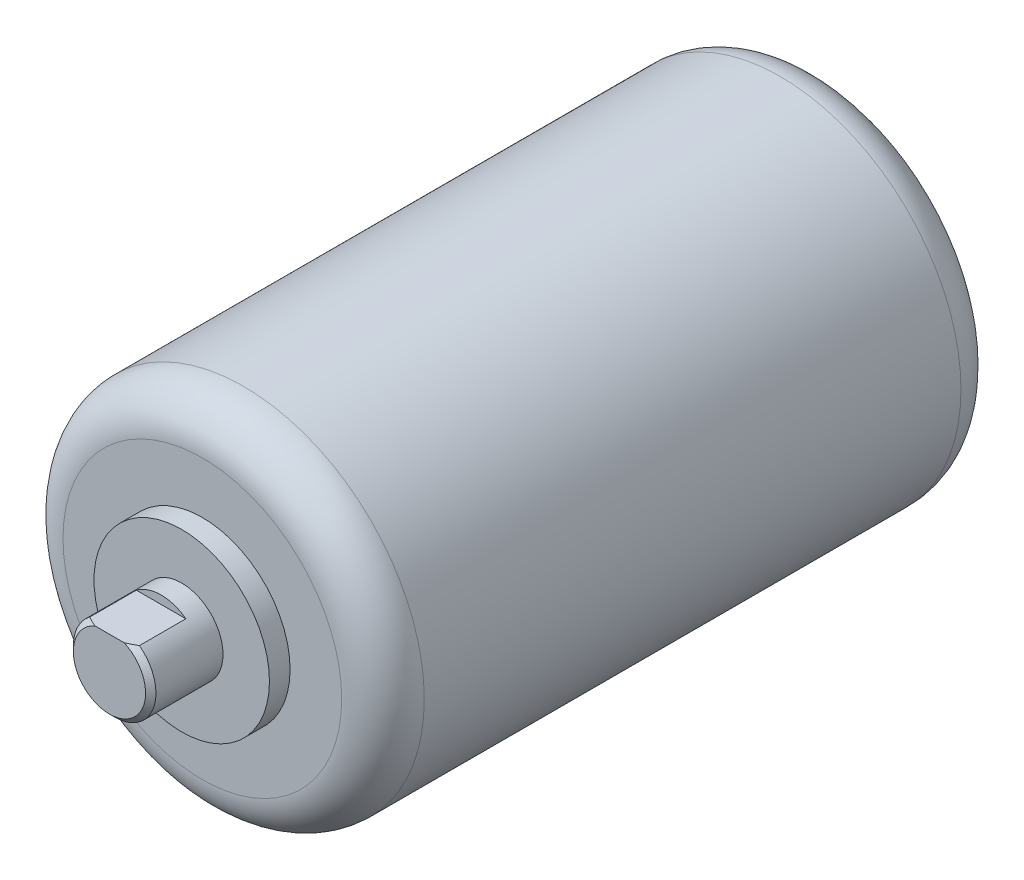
ISO-10303-21;
HEADER;
FILE_DESCRIPTION(('STEP AP214'),'2;1');
FILE_NAME('part.step','',(''),(''),'','','');
FILE_SCHEMA(('AUTOMOTIVE_DESIGN { 1 0 10303 214 1 1 1 1 }'));
ENDSEC;
DATA;
#1=APPLICATION_CONTEXT('core data for automotive mechanical design processes');
#2=APPLICATION_PROTOCOL_DEFINITION('international standard','automotive_design',2000,#1);
#3=PRODUCT_CONTEXT('',#1,'mechanical');
#4=PRODUCT('Part','Part','',(#3));
#5=PRODUCT_RELATED_PRODUCT_CATEGORY('part','',(#4));
#6=PRODUCT_DEFINITION_FORMATION('','',#4);
#7=PRODUCT_DEFINITION_CONTEXT('part definition',#1,'design');
#8=PRODUCT_DEFINITION('design','',#6,#7);
#9=PRODUCT_DEFINITION_SHAPE('','',#8);
#10=(LENGTH_UNIT() NAMED_UNIT(*) SI_UNIT(.MILLI.,.METRE.));
#11=(NAMED_UNIT(*) PLANE_ANGLE_UNIT() SI_UNIT($,.RADIAN.));
#12=(NAMED_UNIT(*) SI_UNIT($,.STERADIAN.) SOLID_ANGLE_UNIT());
#13=UNCERTAINTY_MEASURE_WITH_UNIT(LENGTH_MEASURE(1.E-05),#10,'distance_accuracy_value','');
#14=(GEOMETRIC_REPRESENTATION_CONTEXT(3) GLOBAL_UNCERTAINTY_ASSIGNED_CONTEXT((#13)) GLOBAL_UNIT_ASSIGNED_CONTEXT((#10,
#11,#12)) REPRESENTATION_CONTEXT('',''));
#15=CARTESIAN_POINT('',(0.,0.,0.));
#16=DIRECTION('',(0.,0.,1.));
#17=DIRECTION('',(1.,0.,0.));
#18=AXIS2_PLACEMENT_3D('',#15,#16,#17);
#19=CARTESIAN_POINT('',(0.,0.,62.));
#20=DIRECTION('',(0.,0.,1.));
#21=DIRECTION('',(1.,0.,0.));
#22=AXIS2_PLACEMENT_3D('',#19,#20,#21);
#23=PLANE('',#22);
#24=CARTESIAN_POINT('',(0.,0.,62.));
#25=DIRECTION('',(0.,0.,1.));
#26=DIRECTION('',(1.,0.,0.));
#27=AXIS2_PLACEMENT_3D('',#24,#25,#26);
#28=CIRCLE('',#27,8.5);
#29=CARTESIAN_POINT('',(8.5,0.,62.));
#30=VERTEX_POINT('',#29);
#31=EDGE_CURVE('E83',#30,#30,#28,.T.);
#32=ORIENTED_EDGE('',*,*,#31,.T.);
#33=EDGE_LOOP('',(#32));
#34=FACE_BOUND('',#33,.T.);
#35=CARTESIAN_POINT('',(0.,0.,62.));
#36=DIRECTION('',(0.,0.,1.));
#37=DIRECTION('',(1.,0.,0.));
#38=AXIS2_PLACEMENT_3D('',#35,#36,#37);
#39=CIRCLE('',#38,4.);
#40=CARTESIAN_POINT('',(4.,0.,62.));
#41=VERTEX_POINT('',#40);
#42=EDGE_CURVE('E67',#41,#41,#39,.T.);
#43=ORIENTED_EDGE('',*,*,#42,.F.);
#44=EDGE_LOOP('',(#43));
#45=FACE_BOUND('',#44,.T.);
#46=ADVANCED_FACE('F26',(#34,#45),#23,.T.);
#47=CARTESIAN_POINT('',(0.,0.,60.));
#48=DIRECTION('',(0.,0.,1.));
#49=DIRECTION('',(1.,0.,0.));
#50=AXIS2_PLACEMENT_3D('',#47,#48,#49);
#51=PLANE('',#50);
#52=CARTESIAN_POINT('',(0.,0.,60.));
#53=DIRECTION('',(0.,0.,1.));
#54=DIRECTION('',(1.,0.,0.));
#55=AXIS2_PLACEMENT_3D('',#52,#53,#54);
#56=CIRCLE('',#55,13.5);
#57=CARTESIAN_POINT('',(13.5,0.,60.));
#58=VERTEX_POINT('',#57);
#59=EDGE_CURVE('E96',#58,#58,#56,.T.);
#60=ORIENTED_EDGE('',*,*,#59,.T.);
#61=EDGE_LOOP('',(#60));
#62=FACE_BOUND('',#61,.T.);
#63=CARTESIAN_POINT('',(0.,0.,60.));
#64=DIRECTION('',(0.,0.,1.));
#65=DIRECTION('',(1.,0.,0.));
#66=AXIS2_PLACEMENT_3D('',#63,#64,#65);
#67=CIRCLE('',#66,8.5);
#68=CARTESIAN_POINT('',(8.5,0.,60.));
#69=VERTEX_POINT('',#68);
#70=EDGE_CURVE('E80',#69,#69,#67,.T.);
#71=ORIENTED_EDGE('',*,*,#70,.F.);
#72=EDGE_LOOP('',(#71));
#73=FACE_BOUND('',#72,.T.);
#74=ADVANCED_FACE('F133',(#62,#73),#51,.T.);
#75=CARTESIAN_POINT('',(0.,0.,60.));
#76=DIRECTION('',(0.,0.,-1.));
#77=DIRECTION('',(-1.,0.,0.));
#78=AXIS2_PLACEMENT_3D('',#75,#76,#77);
#79=CYLINDRICAL_SURFACE('',#78,17.5);
#80=CARTESIAN_POINT('',(0.,0.,56.));
#81=DIRECTION('',(0.,0.,1.));
#82=DIRECTION('',(1.,0.,0.));
#83=AXIS2_PLACEMENT_3D('',#80,#81,#82);
#84=CIRCLE('',#83,17.5);
#85=CARTESIAN_POINT('',(17.5,0.,56.));
#86=VERTEX_POINT('',#85);
#87=EDGE_CURVE('E99',#86,#86,#84,.F.);
#88=ORIENTED_EDGE('',*,*,#87,.T.);
#89=EDGE_LOOP('',(#88));
#90=FACE_BOUND('',#89,.T.);
#91=CARTESIAN_POINT('',(0.,0.,4.));
#92=DIRECTION('',(0.,0.,1.));
#93=DIRECTION('',(1.,0.,0.));
#94=AXIS2_PLACEMENT_3D('',#91,#92,#93);
#95=CIRCLE('',#94,17.5);
#96=CARTESIAN_POINT('',(17.5,0.,4.));
#97=VERTEX_POINT('',#96);
#98=EDGE_CURVE('E90',#97,#97,#95,.T.);
#99=ORIENTED_EDGE('',*,*,#98,.T.);
#100=EDGE_LOOP('',(#99));
#101=FACE_BOUND('',#100,.T.);
#102=ADVANCED_FACE('F28',(#90,#101),#79,.T.);
#103=CARTESIAN_POINT('',(0.,0.,0.));
#104=DIRECTION('',(0.,0.,1.));
#105=DIRECTION('',(1.,0.,0.));
#106=AXIS2_PLACEMENT_3D('',#103,#104,#105);
#107=PLANE('',#106);
#108=CARTESIAN_POINT('',(0.,0.,0.));
#109=DIRECTION('',(0.,0.,1.));
#110=DIRECTION('',(1.,0.,0.));
#111=AXIS2_PLACEMENT_3D('',#108,#109,#110);
#112=CIRCLE('',#111,13.5);
#113=CARTESIAN_POINT('',(13.5,0.,0.));
#114=VERTEX_POINT('',#113);
#115=EDGE_CURVE('E93',#114,#114,#112,.F.);
#116=ORIENTED_EDGE('',*,*,#115,.T.);
#117=EDGE_LOOP('',(#116));
#118=FACE_BOUND('',#117,.T.);
#119=ADVANCED_FACE('F146',(#118),#107,.F.);
#120=CARTESIAN_POINT('',(0.,0.,62.));
#121=DIRECTION('',(0.,0.,-1.));
#122=DIRECTION('',(-1.,0.,0.));
#123=AXIS2_PLACEMENT_3D('',#120,#121,#122);
#124=CYLINDRICAL_SURFACE('',#123,8.5);
#125=ORIENTED_EDGE('',*,*,#31,.F.);
#126=EDGE_LOOP('',(#125));
#127=FACE_BOUND('',#126,.T.);
#128=ORIENTED_EDGE('',*,*,#70,.T.);
#129=EDGE_LOOP('',(#128));
#130=FACE_BOUND('',#129,.T.);
#131=ADVANCED_FACE('F143',(#127,#130),#124,.T.);
#132=CARTESIAN_POINT('',(0.,0.,69.));
#133=DIRECTION('',(0.,0.,-1.));
#134=DIRECTION('',(-1.,0.,0.));
#135=AXIS2_PLACEMENT_3D('',#132,#133,#134);
#136=CYLINDRICAL_SURFACE('',#135,4.);
#137=CARTESIAN_POINT('',(0.,0.,68.5));
#138=DIRECTION('',(0.,0.,1.));
#139=DIRECTION('',(1.,0.,0.));
#140=AXIS2_PLACEMENT_3D('',#137,#138,#139);
#141=CIRCLE('',#140,4.);
#142=CARTESIAN_POINT('',(2.4,3.2,68.5));
#143=VERTEX_POINT('',#142);
#144=CARTESIAN_POINT('',(-2.4,3.2,68.5));
#145=VERTEX_POINT('',#144);
#146=EDGE_CURVE('E74',#143,#145,#141,.F.);
#147=ORIENTED_EDGE('',*,*,#146,.T.);
#148=DIRECTION('',(0.,0.,1.));
#149=VECTOR('',#148,1.);
#150=CARTESIAN_POINT('',(-2.4,3.2,64.));
#151=LINE('',#150,#149);
#152=CARTESIAN_POINT('',(-2.4,3.2,64.));
#153=VERTEX_POINT('',#152);
#154=EDGE_CURVE('E47',#153,#145,#151,.T.);
#155=ORIENTED_EDGE('',*,*,#154,.F.);
#156=CARTESIAN_POINT('',(0.,0.,64.));
#157=DIRECTION('',(0.,0.,-1.));
#158=DIRECTION('',(-1.,0.,0.));
#159=AXIS2_PLACEMENT_3D('',#156,#157,#158);
#160=CIRCLE('',#159,4.);
#161=CARTESIAN_POINT('',(2.4,3.2,64.));
#162=VERTEX_POINT('',#161);
#163=EDGE_CURVE('E11',#153,#162,#160,.T.);
#164=ORIENTED_EDGE('',*,*,#163,.T.);
#165=DIRECTION('',(0.,0.,1.));
#166=VECTOR('',#165,1.);
#167=CARTESIAN_POINT('',(2.4,3.2,64.));
#168=LINE('',#167,#166);
#169=EDGE_CURVE('E59',#162,#143,#168,.T.);
#170=ORIENTED_EDGE('',*,*,#169,.T.);
#171=EDGE_LOOP('',(#147,#155,#164,#170));
#172=FACE_BOUND('',#171,.T.);
#173=ORIENTED_EDGE('',*,*,#42,.T.);
#174=EDGE_LOOP('',(#173));
#175=FACE_BOUND('',#174,.T.);
#176=ADVANCED_FACE('F72',(#172,#175),#136,.T.);
#177=CARTESIAN_POINT('',(0.,0.,69.));
#178=DIRECTION('',(0.,0.,1.));
#179=DIRECTION('',(1.,0.,0.));
#180=AXIS2_PLACEMENT_3D('',#177,#178,#179);
#181=PLANE('',#180);
#182=DIRECTION('',(1.,0.,0.));
#183=VECTOR('',#182,1.);
#184=CARTESIAN_POINT('',(-2.4,3.2,69.));
#185=LINE('',#184,#183);
#186=CARTESIAN_POINT('',(-1.41774468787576,3.2,69.));
#187=VERTEX_POINT('',#186);
#188=CARTESIAN_POINT('',(1.41774468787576,3.2,69.));
#189=VERTEX_POINT('',#188);
#190=EDGE_CURVE('E41',#187,#189,#185,.T.);
#191=ORIENTED_EDGE('',*,*,#190,.F.);
#192=CARTESIAN_POINT('',(0.,0.,69.));
#193=DIRECTION('',(0.,0.,1.));
#194=DIRECTION('',(1.,0.,0.));
#195=AXIS2_PLACEMENT_3D('',#192,#193,#194);
#196=CIRCLE('',#195,3.49999999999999);
#197=EDGE_CURVE('E86',#187,#189,#196,.T.);
#198=ORIENTED_EDGE('',*,*,#197,.T.);
#199=EDGE_LOOP('',(#191,#198));
#200=FACE_BOUND('',#199,.T.);
#201=ADVANCED_FACE('F128',(#200),#181,.T.);
#202=CARTESIAN_POINT('',(0.,0.,69.));
#203=DIRECTION('',(0.,0.,-1.));
#204=DIRECTION('',(-1.,0.,0.));
#205=AXIS2_PLACEMENT_3D('',#202,#203,#204);
#206=CONICAL_SURFACE('',#205,3.49999999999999,0.785398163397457);
#207=CARTESIAN_POINT('',(-5.04855950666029,3.2,66.5227135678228));
#208=CARTESIAN_POINT('',(-4.9205712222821,3.2,66.6307884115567));
#209=CARTESIAN_POINT('',(-4.792022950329,3.2,66.7382101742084));
#210=CARTESIAN_POINT('',(-4.53349895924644,3.2,66.9513805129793));
#211=CARTESIAN_POINT('',(-4.40352292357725,3.2,67.05712870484));
#212=CARTESIAN_POINT('',(-4.14100025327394,3.2,67.2672506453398));
#213=CARTESIAN_POINT('',(-4.00844212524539,3.2,67.3716100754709));
#214=CARTESIAN_POINT('',(-3.74125537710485,3.2,67.5776281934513));
#215=CARTESIAN_POINT('',(-3.60662694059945,3.2,67.6792871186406));
#216=CARTESIAN_POINT('',(-3.34025523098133,3.2,67.8751235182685));
#217=CARTESIAN_POINT('',(-3.20861272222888,3.2,67.9694375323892));
#218=CARTESIAN_POINT('',(-2.94243560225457,3.2,68.1538854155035));
#219=CARTESIAN_POINT('',(-2.80790131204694,3.2,68.2440197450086));
#220=CARTESIAN_POINT('',(-2.53553275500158,3.2,68.4185773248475));
#221=CARTESIAN_POINT('',(-2.3977056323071,3.2,68.5030116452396));
#222=CARTESIAN_POINT('',(-2.11776533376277,3.2,68.6643975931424));
#223=CARTESIAN_POINT('',(-1.97565421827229,3.2,68.741352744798));
#224=CARTESIAN_POINT('',(-1.70644243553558,3.2,68.8750487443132));
#225=CARTESIAN_POINT('',(-1.58000426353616,3.2,68.9331123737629));
#226=CARTESIAN_POINT('',(-1.32310801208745,3.2,69.0392236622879));
#227=CARTESIAN_POINT('',(-1.19265616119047,3.2,69.0872860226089));
#228=CARTESIAN_POINT('',(-0.992898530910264,3.2,69.1501093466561));
#229=CARTESIAN_POINT('',(-0.925076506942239,3.2,69.169622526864));
#230=CARTESIAN_POINT('',(-0.788480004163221,3.2,69.2049510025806));
#231=CARTESIAN_POINT('',(-0.719705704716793,3.2,69.2207669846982));
#232=CARTESIAN_POINT('',(-0.580954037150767,3.2,69.2484049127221));
#233=CARTESIAN_POINT('',(-0.510972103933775,3.2,69.2602041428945));
#234=CARTESIAN_POINT('',(-0.370356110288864,3.2,69.2793980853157));
#235=CARTESIAN_POINT('',(-0.299721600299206,3.2,69.2867894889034));
#236=CARTESIAN_POINT('',(-0.228901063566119,3.2,69.2918236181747));
#237=B_SPLINE_CURVE_WITH_KNOTS('',3,(#207,#208,#209,#210,#211,#212,#213,#214,#215,#216,#217,
#218,#219,#220,#221,#222,#223,#224,#225,#226,#227,#228,#229,#230,#231,#232,#233,#234,#235,#236),
.UNSPECIFIED.,.F.,.F.,(4,2,2,2,2,2,2,2,2,2,2,2,2,2,4),(0.,0.50255162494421,1.00521701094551,
1.51131524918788,2.01736885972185,2.50313128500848,2.98884006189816,3.47357665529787,
3.95808372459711,4.37518069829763,4.79166016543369,5.00329417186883,5.21488884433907,
5.42766099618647,5.64059266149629),.UNSPECIFIED.);
#238=EDGE_CURVE('E34',#145,#187,#237,.T.);
#239=ORIENTED_EDGE('',*,*,#238,.F.);
#240=ORIENTED_EDGE('',*,*,#146,.F.);
#241=CARTESIAN_POINT('',(0.228901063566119,3.2,69.2918236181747));
#242=CARTESIAN_POINT('',(0.281221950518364,3.2,69.2880950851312));
#243=CARTESIAN_POINT('',(0.333441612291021,3.2,69.2830908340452));
#244=CARTESIAN_POINT('',(0.437574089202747,3.2,69.270633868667));
#245=CARTESIAN_POINT('',(0.489486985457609,3.2,69.2631818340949));
#246=CARTESIAN_POINT('',(0.644426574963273,3.2,69.237341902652));
#247=CARTESIAN_POINT('',(0.746883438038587,3.2,69.2154529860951));
#248=CARTESIAN_POINT('',(0.948497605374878,3.2,69.1637981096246));
#249=CARTESIAN_POINT('',(1.04767920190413,3.2,69.1341247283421));
#250=CARTESIAN_POINT('',(1.24377734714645,3.2,69.0680246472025));
#251=CARTESIAN_POINT('',(1.34069324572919,3.2,69.0315960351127));
#252=CARTESIAN_POINT('',(1.50321100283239,3.2,68.9650411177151));
#253=CARTESIAN_POINT('',(1.56940804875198,3.2,68.9363469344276));
#254=CARTESIAN_POINT('',(1.66798569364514,3.2,68.891493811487));
#255=CARTESIAN_POINT('',(1.70077036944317,3.2,68.876218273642));
#256=CARTESIAN_POINT('',(1.76607367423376,3.2,68.8451137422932));
#257=CARTESIAN_POINT('',(1.79859231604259,3.2,68.8292847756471));
#258=CARTESIAN_POINT('',(1.98058999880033,3.2,68.7389037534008));
#259=CARTESIAN_POINT('',(2.12749324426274,3.2,68.6591254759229));
#260=CARTESIAN_POINT('',(2.41674850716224,3.2,68.4916622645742));
#261=CARTESIAN_POINT('',(2.55909764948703,3.2,68.4039724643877));
#262=CARTESIAN_POINT('',(2.84047576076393,3.2,68.2225340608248));
#263=CARTESIAN_POINT('',(2.97949327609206,3.2,68.1287677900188));
#264=CARTESIAN_POINT('',(3.25444708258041,3.2,67.9369156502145));
#265=CARTESIAN_POINT('',(3.39038407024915,3.2,67.8388307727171));
#266=CARTESIAN_POINT('',(3.65615529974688,3.2,67.6420458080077));
#267=CARTESIAN_POINT('',(3.78605517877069,3.2,67.5434340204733));
#268=CARTESIAN_POINT('',(4.04395900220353,3.2,67.3437462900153));
#269=CARTESIAN_POINT('',(4.1719627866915,3.2,67.2426701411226));
#270=CARTESIAN_POINT('',(4.42547119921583,3.2,67.0393136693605));
#271=CARTESIAN_POINT('',(4.55098725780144,3.2,66.9370475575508));
#272=CARTESIAN_POINT('',(4.80069663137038,3.2,66.7309627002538));
#273=CARTESIAN_POINT('',(4.92489020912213,3.2,66.6271442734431));
#274=CARTESIAN_POINT('',(5.04855950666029,3.2,66.5227135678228));
#275=B_SPLINE_CURVE_WITH_KNOTS('',3,(#241,#242,#243,#244,#245,#246,#247,#248,#249,#250,#251,
#252,#253,#254,#255,#256,#257,#258,#259,#260,#261,#262,#263,#264,#265,#266,#267,#268,#269,#270,
#271,#272,#273,#274),.UNSPECIFIED.,.F.,.F.,(4,2,2,2,2,2,2,2,2,2,2,2,2,2,2,2,4),(0.,
0.157327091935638,0.314610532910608,0.628490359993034,0.938794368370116,1.24918635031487,
1.46558376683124,1.5740848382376,1.68258065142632,2.18368028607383,2.68509027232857,
3.18802990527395,3.69085466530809,4.18008741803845,4.66936120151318,5.15505703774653,
5.64065449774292),.UNSPECIFIED.);
#276=EDGE_CURVE('E63',#189,#143,#275,.T.);
#277=ORIENTED_EDGE('',*,*,#276,.F.);
#278=ORIENTED_EDGE('',*,*,#197,.F.);
#279=EDGE_LOOP('',(#239,#240,#277,#278));
#280=FACE_BOUND('',#279,.T.);
#281=ADVANCED_FACE('F110',(#280),#206,.T.);
#282=CARTESIAN_POINT('',(0.,0.,4.));
#283=DIRECTION('',(0.,0.,1.));
#284=DIRECTION('',(1.,0.,0.));
#285=AXIS2_PLACEMENT_3D('',#282,#283,#284);
#286=TOROIDAL_SURFACE('',#285,13.5,4.);
#287=ORIENTED_EDGE('',*,*,#115,.F.);
#288=EDGE_LOOP('',(#287));
#289=FACE_BOUND('',#288,.T.);
#290=ORIENTED_EDGE('',*,*,#98,.F.);
#291=EDGE_LOOP('',(#290));
#292=FACE_BOUND('',#291,.T.);
#293=ADVANCED_FACE('F121',(#289,#292),#286,.T.);
#294=CARTESIAN_POINT('',(0.,0.,56.));
#295=DIRECTION('',(0.,0.,1.));
#296=DIRECTION('',(1.,0.,0.));
#297=AXIS2_PLACEMENT_3D('',#294,#295,#296);
#298=TOROIDAL_SURFACE('',#297,13.5,4.);
#299=ORIENTED_EDGE('',*,*,#87,.F.);
#300=EDGE_LOOP('',(#299));
#301=FACE_BOUND('',#300,.T.);
#302=ORIENTED_EDGE('',*,*,#59,.F.);
#303=EDGE_LOOP('',(#302));
#304=FACE_BOUND('',#303,.T.);
#305=ADVANCED_FACE('F118',(#301,#304),#298,.T.);
#306=CARTESIAN_POINT('',(-2.4,4.35951303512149,64.));
#307=DIRECTION('',(0.,0.,-1.));
#308=DIRECTION('',(-1.,0.,0.));
#309=AXIS2_PLACEMENT_3D('',#306,#307,#308);
#310=PLANE('',#309);
#311=DIRECTION('',(1.,0.,0.));
#312=VECTOR('',#311,1.);
#313=CARTESIAN_POINT('',(-2.4,3.2,64.));
#314=LINE('',#313,#312);
#315=EDGE_CURVE('E62',#153,#162,#314,.T.);
#316=ORIENTED_EDGE('',*,*,#315,.T.);
#317=ORIENTED_EDGE('',*,*,#163,.F.);
#318=EDGE_LOOP('',(#316,#317));
#319=FACE_BOUND('',#318,.T.);
#320=ADVANCED_FACE('F70',(#319),#310,.F.);
#321=CARTESIAN_POINT('',(-2.4,3.2,64.));
#322=DIRECTION('',(0.,-1.,0.));
#323=DIRECTION('',(0.,0.,-1.));
#324=AXIS2_PLACEMENT_3D('',#321,#322,#323);
#325=PLANE('',#324);
#326=ORIENTED_EDGE('',*,*,#238,.T.);
#327=ORIENTED_EDGE('',*,*,#190,.T.);
#328=ORIENTED_EDGE('',*,*,#276,.T.);
#329=ORIENTED_EDGE('',*,*,#169,.F.);
#330=ORIENTED_EDGE('',*,*,#315,.F.);
#331=ORIENTED_EDGE('',*,*,#154,.T.);
#332=EDGE_LOOP('',(#326,#327,#328,#329,#330,#331));
#333=FACE_BOUND('',#332,.T.);
#334=ADVANCED_FACE('F61',(#333),#325,.F.);
#335=CLOSED_SHELL('',(#46,#74,#102,#119,#131,#176,#201,#281,#293,#305,#320,#334));
#336=MANIFOLD_SOLID_BREP('B2',#335);
#337=ADVANCED_BREP_SHAPE_REPRESENTATION('',(#18,#336),#14);
#338=SHAPE_DEFINITION_REPRESENTATION(#9,#337);
ENDSEC;
END-ISO-10303-21;
